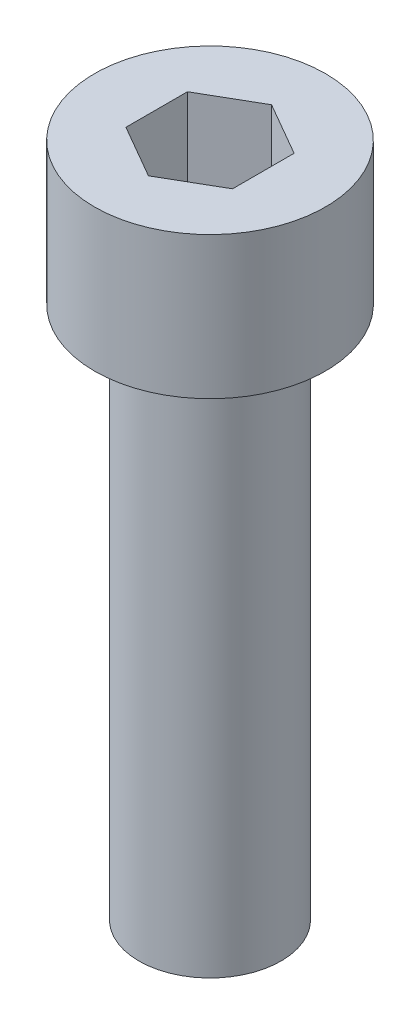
ISO-10303-21;
HEADER;
FILE_DESCRIPTION(('STEP AP214'),'2;1');
FILE_NAME('part.step','',(''),(''),'','','');
FILE_SCHEMA(('AUTOMOTIVE_DESIGN { 1 0 10303 214 1 1 1 1 }'));
ENDSEC;
DATA;
#1=APPLICATION_CONTEXT('core data for automotive mechanical design processes');
#2=APPLICATION_PROTOCOL_DEFINITION('international standard','automotive_design',2000,#1);
#3=PRODUCT_CONTEXT('',#1,'mechanical');
#4=PRODUCT('Part','Part','',(#3));
#5=PRODUCT_RELATED_PRODUCT_CATEGORY('part','',(#4));
#6=PRODUCT_DEFINITION_FORMATION('','',#4);
#7=PRODUCT_DEFINITION_CONTEXT('part definition',#1,'design');
#8=PRODUCT_DEFINITION('design','',#6,#7);
#9=PRODUCT_DEFINITION_SHAPE('','',#8);
#10=(LENGTH_UNIT() NAMED_UNIT(*) SI_UNIT(.MILLI.,.METRE.));
#11=(NAMED_UNIT(*) PLANE_ANGLE_UNIT() SI_UNIT($,.RADIAN.));
#12=(NAMED_UNIT(*) SI_UNIT($,.STERADIAN.) SOLID_ANGLE_UNIT());
#13=UNCERTAINTY_MEASURE_WITH_UNIT(LENGTH_MEASURE(1.E-05),#10,'distance_accuracy_value','');
#14=(GEOMETRIC_REPRESENTATION_CONTEXT(3) GLOBAL_UNCERTAINTY_ASSIGNED_CONTEXT((#13)) GLOBAL_UNIT_ASSIGNED_CONTEXT((#10,
#11,#12)) REPRESENTATION_CONTEXT('',''));
#15=CARTESIAN_POINT('',(0.,0.,0.));
#16=DIRECTION('',(0.,0.,1.));
#17=DIRECTION('',(1.,0.,0.));
#18=AXIS2_PLACEMENT_3D('',#15,#16,#17);
#19=CARTESIAN_POINT('',(0.,-30.,0.));
#20=DIRECTION('',(0.,1.,0.));
#21=DIRECTION('',(0.,0.,1.));
#22=AXIS2_PLACEMENT_3D('',#19,#20,#21);
#23=PLANE('',#22);
#24=CARTESIAN_POINT('',(0.,-30.,0.));
#25=DIRECTION('',(0.,1.,0.));
#26=DIRECTION('',(0.,0.,1.));
#27=AXIS2_PLACEMENT_3D('',#24,#25,#26);
#28=CIRCLE('',#27,4.);
#29=CARTESIAN_POINT('',(0.,-30.,4.));
#30=VERTEX_POINT('',#29);
#31=EDGE_CURVE('E10',#30,#30,#28,.T.);
#32=ORIENTED_EDGE('',*,*,#31,.F.);
#33=EDGE_LOOP('',(#32));
#34=FACE_BOUND('',#33,.T.);
#35=ADVANCED_FACE('F16',(#34),#23,.F.);
#36=CARTESIAN_POINT('',(0.,0.,0.));
#37=DIRECTION('',(0.,1.,0.));
#38=DIRECTION('',(0.,0.,1.));
#39=AXIS2_PLACEMENT_3D('',#36,#37,#38);
#40=CYLINDRICAL_SURFACE('',#39,4.);
#41=CARTESIAN_POINT('',(0.,0.,0.));
#42=DIRECTION('',(0.,1.,0.));
#43=DIRECTION('',(0.,0.,1.));
#44=AXIS2_PLACEMENT_3D('',#41,#42,#43);
#45=CIRCLE('',#44,4.);
#46=CARTESIAN_POINT('',(0.,0.,4.));
#47=VERTEX_POINT('',#46);
#48=EDGE_CURVE('E25',#47,#47,#45,.F.);
#49=ORIENTED_EDGE('',*,*,#48,.T.);
#50=EDGE_LOOP('',(#49));
#51=FACE_BOUND('',#50,.T.);
#52=ORIENTED_EDGE('',*,*,#31,.T.);
#53=EDGE_LOOP('',(#52));
#54=FACE_BOUND('',#53,.T.);
#55=ADVANCED_FACE('F18',(#51,#54),#40,.T.);
#56=CARTESIAN_POINT('',(3.,2.32,-5.19615242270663));
#57=DIRECTION('',(0.,-1.,0.));
#58=DIRECTION('',(0.,0.,-1.));
#59=AXIS2_PLACEMENT_3D('',#56,#57,#58);
#60=PLANE('',#59);
#61=DIRECTION('',(0.866025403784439,0.,0.5));
#62=VECTOR('',#61,1.);
#63=CARTESIAN_POINT('',(-3.,2.32,1.73205080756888));
#64=LINE('',#63,#62);
#65=CARTESIAN_POINT('',(-3.,2.32,1.73205080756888));
#66=VERTEX_POINT('',#65);
#67=CARTESIAN_POINT('',(0.,2.32,3.46410161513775));
#68=VERTEX_POINT('',#67);
#69=EDGE_CURVE('E90',#66,#68,#64,.T.);
#70=ORIENTED_EDGE('',*,*,#69,.T.);
#71=DIRECTION('',(-0.866025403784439,0.,0.5));
#72=VECTOR('',#71,1.);
#73=CARTESIAN_POINT('',(3.,2.32,1.73205080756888));
#74=LINE('',#73,#72);
#75=CARTESIAN_POINT('',(3.,2.32,1.73205080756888));
#76=VERTEX_POINT('',#75);
#77=EDGE_CURVE('E129',#76,#68,#74,.T.);
#78=ORIENTED_EDGE('',*,*,#77,.F.);
#79=DIRECTION('',(0.,0.,1.));
#80=VECTOR('',#79,1.);
#81=CARTESIAN_POINT('',(3.,2.32,-1.73205080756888));
#82=LINE('',#81,#80);
#83=CARTESIAN_POINT('',(3.,2.32,-1.73205080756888));
#84=VERTEX_POINT('',#83);
#85=EDGE_CURVE('E123',#84,#76,#82,.T.);
#86=ORIENTED_EDGE('',*,*,#85,.F.);
#87=DIRECTION('',(-0.866025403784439,0.,-0.5));
#88=VECTOR('',#87,1.);
#89=CARTESIAN_POINT('',(3.,2.32,-1.73205080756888));
#90=LINE('',#89,#88);
#91=CARTESIAN_POINT('',(0.,2.32,-3.46410161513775));
#92=VERTEX_POINT('',#91);
#93=EDGE_CURVE('E73',#84,#92,#90,.T.);
#94=ORIENTED_EDGE('',*,*,#93,.T.);
#95=DIRECTION('',(0.866025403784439,0.,-0.5));
#96=VECTOR('',#95,1.);
#97=CARTESIAN_POINT('',(-3.,2.32,-1.73205080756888));
#98=LINE('',#97,#96);
#99=CARTESIAN_POINT('',(-3.,2.32,-1.73205080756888));
#100=VERTEX_POINT('',#99);
#101=EDGE_CURVE('E69',#100,#92,#98,.T.);
#102=ORIENTED_EDGE('',*,*,#101,.F.);
#103=DIRECTION('',(0.,0.,1.));
#104=VECTOR('',#103,1.);
#105=CARTESIAN_POINT('',(-3.,2.32,-1.73205080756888));
#106=LINE('',#105,#104);
#107=EDGE_CURVE('E66',#100,#66,#106,.T.);
#108=ORIENTED_EDGE('',*,*,#107,.T.);
#109=EDGE_LOOP('',(#70,#78,#86,#94,#102,#108));
#110=FACE_BOUND('',#109,.T.);
#111=ADVANCED_FACE('F71',(#110),#60,.F.);
#112=CARTESIAN_POINT('',(-3.,2.32,-1.73205080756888));
#113=DIRECTION('',(0.5,0.,0.866025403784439));
#114=DIRECTION('',(0.866025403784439,0.,-0.5));
#115=AXIS2_PLACEMENT_3D('',#112,#113,#114);
#116=PLANE('',#115);
#117=DIRECTION('',(-0.866025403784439,0.,0.5));
#118=VECTOR('',#117,1.);
#119=CARTESIAN_POINT('',(0.,8.,-3.46410161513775));
#120=LINE('',#119,#118);
#121=CARTESIAN_POINT('',(0.,8.,-3.46410161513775));
#122=VERTEX_POINT('',#121);
#123=CARTESIAN_POINT('',(-3.,8.,-1.73205080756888));
#124=VERTEX_POINT('',#123);
#125=EDGE_CURVE('E81',#122,#124,#120,.T.);
#126=ORIENTED_EDGE('',*,*,#125,.T.);
#127=DIRECTION('',(0.,1.,0.));
#128=VECTOR('',#127,1.);
#129=CARTESIAN_POINT('',(-3.,2.32,-1.73205080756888));
#130=LINE('',#129,#128);
#131=EDGE_CURVE('E76',#124,#100,#130,.F.);
#132=ORIENTED_EDGE('',*,*,#131,.T.);
#133=ORIENTED_EDGE('',*,*,#101,.T.);
#134=DIRECTION('',(0.,1.,0.));
#135=VECTOR('',#134,1.);
#136=CARTESIAN_POINT('',(0.,2.32,-3.46410161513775));
#137=LINE('',#136,#135);
#138=EDGE_CURVE('E116',#92,#122,#137,.T.);
#139=ORIENTED_EDGE('',*,*,#138,.T.);
#140=EDGE_LOOP('',(#126,#132,#133,#139));
#141=FACE_BOUND('',#140,.T.);
#142=ADVANCED_FACE('F79',(#141),#116,.T.);
#143=CARTESIAN_POINT('',(-3.,2.32,-1.73205080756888));
#144=DIRECTION('',(-1.,0.,0.));
#145=DIRECTION('',(0.,0.,1.));
#146=AXIS2_PLACEMENT_3D('',#143,#144,#145);
#147=PLANE('',#146);
#148=ORIENTED_EDGE('',*,*,#107,.F.);
#149=ORIENTED_EDGE('',*,*,#131,.F.);
#150=DIRECTION('',(0.,0.,-1.));
#151=VECTOR('',#150,1.);
#152=CARTESIAN_POINT('',(-3.,8.,0.));
#153=LINE('',#152,#151);
#154=CARTESIAN_POINT('',(-3.,8.,1.73205080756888));
#155=VERTEX_POINT('',#154);
#156=EDGE_CURVE('E113',#124,#155,#153,.F.);
#157=ORIENTED_EDGE('',*,*,#156,.T.);
#158=DIRECTION('',(0.,1.,0.));
#159=VECTOR('',#158,1.);
#160=CARTESIAN_POINT('',(-3.,2.32,1.73205080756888));
#161=LINE('',#160,#159);
#162=EDGE_CURVE('E87',#155,#66,#161,.F.);
#163=ORIENTED_EDGE('',*,*,#162,.T.);
#164=EDGE_LOOP('',(#148,#149,#157,#163));
#165=FACE_BOUND('',#164,.T.);
#166=ADVANCED_FACE('F85',(#165),#147,.F.);
#167=CARTESIAN_POINT('',(-3.,2.32,1.73205080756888));
#168=DIRECTION('',(-0.5,0.,0.866025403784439));
#169=DIRECTION('',(0.866025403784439,0.,0.5));
#170=AXIS2_PLACEMENT_3D('',#167,#168,#169);
#171=PLANE('',#170);
#172=ORIENTED_EDGE('',*,*,#69,.F.);
#173=ORIENTED_EDGE('',*,*,#162,.F.);
#174=DIRECTION('',(0.866025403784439,0.,0.5));
#175=VECTOR('',#174,1.);
#176=CARTESIAN_POINT('',(-3.,8.,1.73205080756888));
#177=LINE('',#176,#175);
#178=CARTESIAN_POINT('',(0.,8.,3.46410161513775));
#179=VERTEX_POINT('',#178);
#180=EDGE_CURVE('E111',#155,#179,#177,.T.);
#181=ORIENTED_EDGE('',*,*,#180,.T.);
#182=DIRECTION('',(0.,1.,0.));
#183=VECTOR('',#182,1.);
#184=CARTESIAN_POINT('',(0.,2.32,3.46410161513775));
#185=LINE('',#184,#183);
#186=EDGE_CURVE('E126',#68,#179,#185,.T.);
#187=ORIENTED_EDGE('',*,*,#186,.F.);
#188=EDGE_LOOP('',(#172,#173,#181,#187));
#189=FACE_BOUND('',#188,.T.);
#190=ADVANCED_FACE('F134',(#189),#171,.F.);
#191=CARTESIAN_POINT('',(3.,2.32,1.73205080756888));
#192=DIRECTION('',(-0.5,0.,-0.866025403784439));
#193=DIRECTION('',(-0.866025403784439,0.,0.5));
#194=AXIS2_PLACEMENT_3D('',#191,#192,#193);
#195=PLANE('',#194);
#196=DIRECTION('',(0.866025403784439,0.,-0.5));
#197=VECTOR('',#196,1.);
#198=CARTESIAN_POINT('',(0.,8.,3.46410161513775));
#199=LINE('',#198,#197);
#200=CARTESIAN_POINT('',(3.,8.,1.73205080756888));
#201=VERTEX_POINT('',#200);
#202=EDGE_CURVE('E107',#179,#201,#199,.T.);
#203=ORIENTED_EDGE('',*,*,#202,.T.);
#204=DIRECTION('',(0.,1.,0.));
#205=VECTOR('',#204,1.);
#206=CARTESIAN_POINT('',(3.,2.32,1.73205080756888));
#207=LINE('',#206,#205);
#208=EDGE_CURVE('E121',#76,#201,#207,.T.);
#209=ORIENTED_EDGE('',*,*,#208,.F.);
#210=ORIENTED_EDGE('',*,*,#77,.T.);
#211=ORIENTED_EDGE('',*,*,#186,.T.);
#212=EDGE_LOOP('',(#203,#209,#210,#211));
#213=FACE_BOUND('',#212,.T.);
#214=ADVANCED_FACE('F138',(#213),#195,.T.);
#215=CARTESIAN_POINT('',(3.,2.32,-1.73205080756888));
#216=DIRECTION('',(-1.,0.,0.));
#217=DIRECTION('',(0.,0.,1.));
#218=AXIS2_PLACEMENT_3D('',#215,#216,#217);
#219=PLANE('',#218);
#220=DIRECTION('',(0.,0.,-1.));
#221=VECTOR('',#220,1.);
#222=CARTESIAN_POINT('',(3.,8.,0.));
#223=LINE('',#222,#221);
#224=CARTESIAN_POINT('',(3.,8.,-1.73205080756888));
#225=VERTEX_POINT('',#224);
#226=EDGE_CURVE('E33',#201,#225,#223,.T.);
#227=ORIENTED_EDGE('',*,*,#226,.T.);
#228=DIRECTION('',(0.,1.,0.));
#229=VECTOR('',#228,1.);
#230=CARTESIAN_POINT('',(3.,2.32,-1.73205080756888));
#231=LINE('',#230,#229);
#232=EDGE_CURVE('E119',#225,#84,#231,.F.);
#233=ORIENTED_EDGE('',*,*,#232,.T.);
#234=ORIENTED_EDGE('',*,*,#85,.T.);
#235=ORIENTED_EDGE('',*,*,#208,.T.);
#236=EDGE_LOOP('',(#227,#233,#234,#235));
#237=FACE_BOUND('',#236,.T.);
#238=ADVANCED_FACE('F139',(#237),#219,.T.);
#239=CARTESIAN_POINT('',(3.,2.32,-1.73205080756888));
#240=DIRECTION('',(0.5,0.,-0.866025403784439));
#241=DIRECTION('',(-0.866025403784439,0.,-0.5));
#242=AXIS2_PLACEMENT_3D('',#239,#240,#241);
#243=PLANE('',#242);
#244=ORIENTED_EDGE('',*,*,#93,.F.);
#245=ORIENTED_EDGE('',*,*,#232,.F.);
#246=DIRECTION('',(-0.866025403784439,0.,-0.5));
#247=VECTOR('',#246,1.);
#248=CARTESIAN_POINT('',(3.,8.,-1.73205080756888));
#249=LINE('',#248,#247);
#250=EDGE_CURVE('E100',#225,#122,#249,.T.);
#251=ORIENTED_EDGE('',*,*,#250,.T.);
#252=ORIENTED_EDGE('',*,*,#138,.F.);
#253=EDGE_LOOP('',(#244,#245,#251,#252));
#254=FACE_BOUND('',#253,.T.);
#255=ADVANCED_FACE('F140',(#254),#243,.F.);
#256=CARTESIAN_POINT('',(6.1,8.,0.));
#257=DIRECTION('',(0.,-1.,0.));
#258=DIRECTION('',(0.,0.,-1.));
#259=AXIS2_PLACEMENT_3D('',#256,#257,#258);
#260=PLANE('',#259);
#261=CARTESIAN_POINT('',(0.,8.,0.));
#262=DIRECTION('',(0.,-1.,0.));
#263=DIRECTION('',(0.,0.,-1.));
#264=AXIS2_PLACEMENT_3D('',#261,#262,#263);
#265=CIRCLE('',#264,6.5);
#266=CARTESIAN_POINT('',(0.,8.,-6.5));
#267=VERTEX_POINT('',#266);
#268=EDGE_CURVE('E98',#267,#267,#265,.T.);
#269=ORIENTED_EDGE('',*,*,#268,.F.);
#270=EDGE_LOOP('',(#269));
#271=FACE_BOUND('',#270,.T.);
#272=ORIENTED_EDGE('',*,*,#226,.F.);
#273=ORIENTED_EDGE('',*,*,#202,.F.);
#274=ORIENTED_EDGE('',*,*,#180,.F.);
#275=ORIENTED_EDGE('',*,*,#156,.F.);
#276=ORIENTED_EDGE('',*,*,#125,.F.);
#277=ORIENTED_EDGE('',*,*,#250,.F.);
#278=EDGE_LOOP('',(#272,#273,#274,#275,#276,#277));
#279=FACE_BOUND('',#278,.T.);
#280=ADVANCED_FACE('F142',(#271,#279),#260,.F.);
#281=CARTESIAN_POINT('',(0.,0.,0.));
#282=DIRECTION('',(0.,1.,0.));
#283=DIRECTION('',(0.,0.,1.));
#284=AXIS2_PLACEMENT_3D('',#281,#282,#283);
#285=CYLINDRICAL_SURFACE('',#284,6.5);
#286=ORIENTED_EDGE('',*,*,#268,.T.);
#287=EDGE_LOOP('',(#286));
#288=FACE_BOUND('',#287,.T.);
#289=CARTESIAN_POINT('',(0.,0.,0.));
#290=DIRECTION('',(0.,1.,0.));
#291=DIRECTION('',(0.,0.,1.));
#292=AXIS2_PLACEMENT_3D('',#289,#290,#291);
#293=CIRCLE('',#292,6.5);
#294=CARTESIAN_POINT('',(0.,0.,6.5));
#295=VERTEX_POINT('',#294);
#296=EDGE_CURVE('E96',#295,#295,#293,.T.);
#297=ORIENTED_EDGE('',*,*,#296,.T.);
#298=EDGE_LOOP('',(#297));
#299=FACE_BOUND('',#298,.T.);
#300=ADVANCED_FACE('F150',(#288,#299),#285,.T.);
#301=CARTESIAN_POINT('',(4.,0.,0.));
#302=DIRECTION('',(0.,1.,0.));
#303=DIRECTION('',(0.,0.,1.));
#304=AXIS2_PLACEMENT_3D('',#301,#302,#303);
#305=PLANE('',#304);
#306=ORIENTED_EDGE('',*,*,#296,.F.);
#307=EDGE_LOOP('',(#306));
#308=FACE_BOUND('',#307,.T.);
#309=ORIENTED_EDGE('',*,*,#48,.F.);
#310=EDGE_LOOP('',(#309));
#311=FACE_BOUND('',#310,.T.);
#312=ADVANCED_FACE('F161',(#308,#311),#305,.F.);
#313=CLOSED_SHELL('',(#35,#55,#111,#142,#166,#190,#214,#238,#255,#280,#300,#312));
#314=MANIFOLD_SOLID_BREP('B1',#313);
#315=ADVANCED_BREP_SHAPE_REPRESENTATION('',(#18,#314),#14);
#316=SHAPE_DEFINITION_REPRESENTATION(#9,#315);
ENDSEC;
END-ISO-10303-21;
